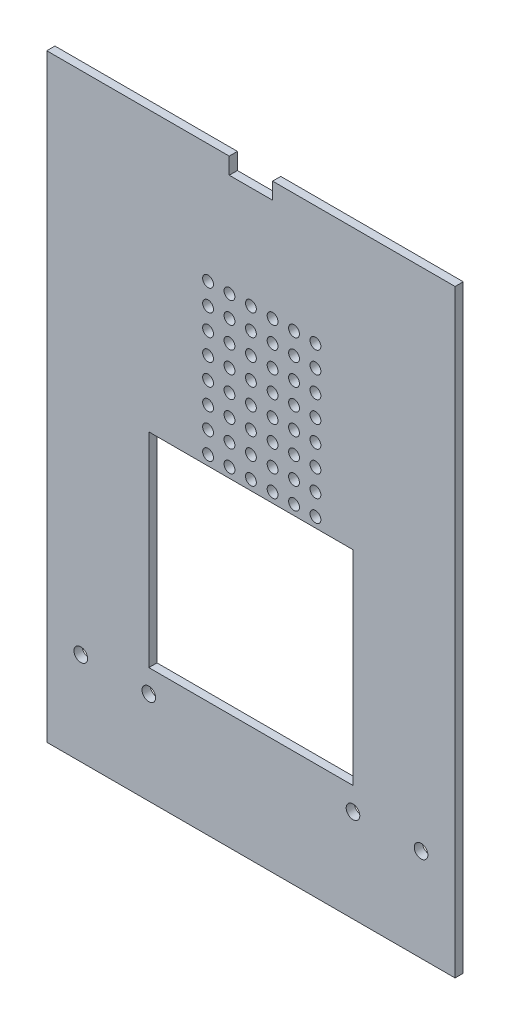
from build123d import *

# Parameters (mm, degrees)
SKETCH1_W           = 152.4
SKETCH1_H           = 292.1
BOSS_EXTRUDE1_DEPTH = 3.048
SKETCH2_R           = 10.7315
SKETCH2_R_2         = 2.0193
SKETCH2_W           = 16.173788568
SKETCH2_H           = 32.6898
SKETCH2_W_2         = 76.2
SKETCH2_H_2         = 76.2
CUT_EXTRUDE1_DEPTH  = 165.761442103
SKETCH4_W           = 152.4
SKETCH4_H           = 63.5
CUT_EXTRUDE2_DEPTH  = 165.761442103
SKETCH5_R           = 2.54
CUT_EXTRUDE3_DEPTH  = 165.761442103
SKETCH6_W           = 152.4
SKETCH6_H           = 5.08
CUT_EXTRUDE4_DEPTH  = 165.761442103


with BuildPart() as part:
    # Sketch1 → Boss-Extrude1 (new body)
    with BuildSketch(Plane.XY):
        Rectangle(SKETCH1_W, SKETCH1_H)
    extrude(amount=BOSS_EXTRUDE1_DEPTH)

    # Sketch2 → Cut-Extrude1 (cut, through all)
    with BuildSketch(Plane.XY):
        with Locations((0, 92.71)):
            Circle(SKETCH2_R)
        with Locations(Location((0, 38.1, 0), (0, 0, 180))):
            Circle(SKETCH2_R_2)
        with Locations(Location((0, 30.1, 0), (0, 0, 180))):
            Circle(SKETCH2_R_2)
        with Locations(Location((0, 22.1, 0), (0, 0, 180))):
            Circle(SKETCH2_R_2)
        with Locations(Location((0, 14.1, 0), (0, 0, 180))):
            Circle(SKETCH2_R_2)
        with Locations(Location((0, 6.1, 0), (0, 0, 180))):
            Circle(SKETCH2_R_2)
        with Locations(Location((0, -1.9, 0), (0, 0, 180))):
            Circle(SKETCH2_R_2)
        with Locations(Location((0, -9.9, 0), (0, 0, 180))):
            Circle(SKETCH2_R_2)
        with Locations(Location((0, -17.9, 0), (0, 0, 180))):
            Circle(SKETCH2_R_2)
        with Locations(Location((-8, 38.1, 0), (0, 0, 180))):
            Circle(SKETCH2_R_2)
        with Locations(Location((-16, 38.1, 0), (0, 0, 180))):
            Circle(SKETCH2_R_2)
        with Locations(Location((-8, 30.1, 0), (0, 0, 180))):
            Circle(SKETCH2_R_2)
        with Locations(Location((-16, 30.1, 0), (0, 0, 180))):
            Circle(SKETCH2_R_2)
        with Locations(Location((-8, 22.1, 0), (0, 0, 180))):
            Circle(SKETCH2_R_2)
        with Locations(Location((-16, 22.1, 0), (0, 0, 180))):
            Circle(SKETCH2_R_2)
        with Locations(Location((-8, 14.1, 0), (0, 0, 180))):
            Circle(SKETCH2_R_2)
        with Locations(Location((-16, 14.1, 0), (0, 0, 180))):
            Circle(SKETCH2_R_2)
        with Locations(Location((-8, 6.1, 0), (0, 0, 180))):
            Circle(SKETCH2_R_2)
        with Locations(Location((-16, 6.1, 0), (0, 0, 180))):
            Circle(SKETCH2_R_2)
        with Locations(Location((-8, -1.9, 0), (0, 0, 180))):
            Circle(SKETCH2_R_2)
        with Locations(Location((-16, -1.9, 0), (0, 0, 180))):
            Circle(SKETCH2_R_2)
        with Locations(Location((-8, -9.9, 0), (0, 0, 180))):
            Circle(SKETCH2_R_2)
        with Locations(Location((-16, -9.9, 0), (0, 0, 180))):
            Circle(SKETCH2_R_2)
        with Locations(Location((-8, -17.9, 0), (0, 0, 180))):
            Circle(SKETCH2_R_2)
        with Locations(Location((-16, -17.9, 0), (0, 0, 180))):
            Circle(SKETCH2_R_2)
        with Locations(Location((24.086894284, 14.1, 0), (0, 0, 180))):
            Circle(SKETCH2_R_2)
        with Locations(Location((8.086894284, 14.1, 0), (0, 0, 180))):
            Circle(SKETCH2_R_2)
        with Locations(Location((8.086894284, -17.9, 0), (0, 0, 180))):
            Circle(SKETCH2_R_2)
        with Locations(Location((24.086894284, 6.1, 0), (0, 0, 180))):
            Circle(SKETCH2_R_2)
        with Locations(Location((16.086894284, 6.1, 0), (0, 0, 180))):
            Circle(SKETCH2_R_2)
        with Locations(Location((8.086894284, -1.9, 0), (0, 0, 180))):
            Circle(SKETCH2_R_2)
        with Locations(Location((8.086894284, 30.1, 0), (0, 0, 180))):
            Circle(SKETCH2_R_2)
        with Locations(Location((24.086894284, 22.1, 0), (0, 0, 180))):
            Circle(SKETCH2_R_2)
        with Locations(Location((24.086894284, -1.9, 0), (0, 0, 180))):
            Circle(SKETCH2_R_2)
        with Locations(Location((24.086894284, -9.9, 0), (0, 0, 180))):
            Circle(SKETCH2_R_2)
        with Locations(Location((8.086894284, 6.1, 0), (0, 0, 180))):
            Circle(SKETCH2_R_2)
        with Locations(Location((16.086894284, 22.1, 0), (0, 0, 180))):
            Circle(SKETCH2_R_2)
        with Locations(Location((8.086894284, 22.1, 0), (0, 0, 180))):
            Circle(SKETCH2_R_2)
        with Locations(Location((8.086894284, -9.9, 0), (0, 0, 180))):
            Circle(SKETCH2_R_2)
        with Locations(Location((24.086894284, -17.9, 0), (0, 0, 180))):
            Circle(SKETCH2_R_2)
        with Locations(Location((16.086894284, 14.1, 0), (0, 0, 180))):
            Circle(SKETCH2_R_2)
        with Locations(Location((16.086894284, -17.9, 0), (0, 0, 180))):
            Circle(SKETCH2_R_2)
        with Locations(Location((16.086894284, 30.1, 0), (0, 0, 180))):
            Circle(SKETCH2_R_2)
        with Locations(Location((24.086894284, 30.1, 0), (0, 0, 180))):
            Circle(SKETCH2_R_2)
        with Locations(Location((16.086894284, -9.9, 0), (0, 0, 180))):
            Circle(SKETCH2_R_2)
        with Locations(Location((16.086894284, -1.9, 0), (0, 0, 180))):
            Circle(SKETCH2_R_2)
        with Locations(Location((16.086894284, 38.1, 0), (0, 0, 180))):
            Circle(SKETCH2_R_2)
        with Locations(Location((8.086894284, 38.1, 0), (0, 0, 180))):
            Circle(SKETCH2_R_2)
        with Locations(Location((24.086894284, 38.1, 0), (0, 0, 180))):
            Circle(SKETCH2_R_2)
        with Locations((0, 92.71)):
            Rectangle(SKETCH2_W, SKETCH2_H)
        with Locations((0, -59.69)):
            Rectangle(SKETCH2_W_2, SKETCH2_H_2)
    extrude(amount=CUT_EXTRUDE1_DEPTH, mode=Mode.SUBTRACT)

    # Sketch4 → Cut-Extrude2 (cut, through all)
    with BuildSketch(Plane.XY):
        with Locations((0, 114.3)):
            Rectangle(SKETCH4_W, SKETCH4_H)
    extrude(amount=CUT_EXTRUDE2_DEPTH, mode=Mode.SUBTRACT)

    # Sketch5 → Cut-Extrude3 (cut, through all)
    with BuildSketch(Plane(origin=(0, 0, 0), x_dir=(-1, 0, 0), z_dir=(0, 0, -1))):
        with Locations((-38.1, -106.299)):
            Circle(SKETCH5_R)
        with Locations((-63.5, -106.299)):
            Circle(SKETCH5_R)
        with Locations((63.5, -106.299)):
            Circle(SKETCH5_R)
        with Locations((38.1, -106.299)):
            Circle(SKETCH5_R)
    extrude(amount=-CUT_EXTRUDE3_DEPTH, mode=Mode.SUBTRACT)

    # Sketch6 → Cut-Extrude4 (cut, through all)
    with BuildSketch(Plane(origin=(0, 0, 0), x_dir=(-1, 0, 0), z_dir=(0, 0, -1))):
        with Locations((0, -143.51)):
            Rectangle(SKETCH6_W, SKETCH6_H)
    extrude(amount=-CUT_EXTRUDE4_DEPTH, mode=Mode.SUBTRACT)


solid = part.part
